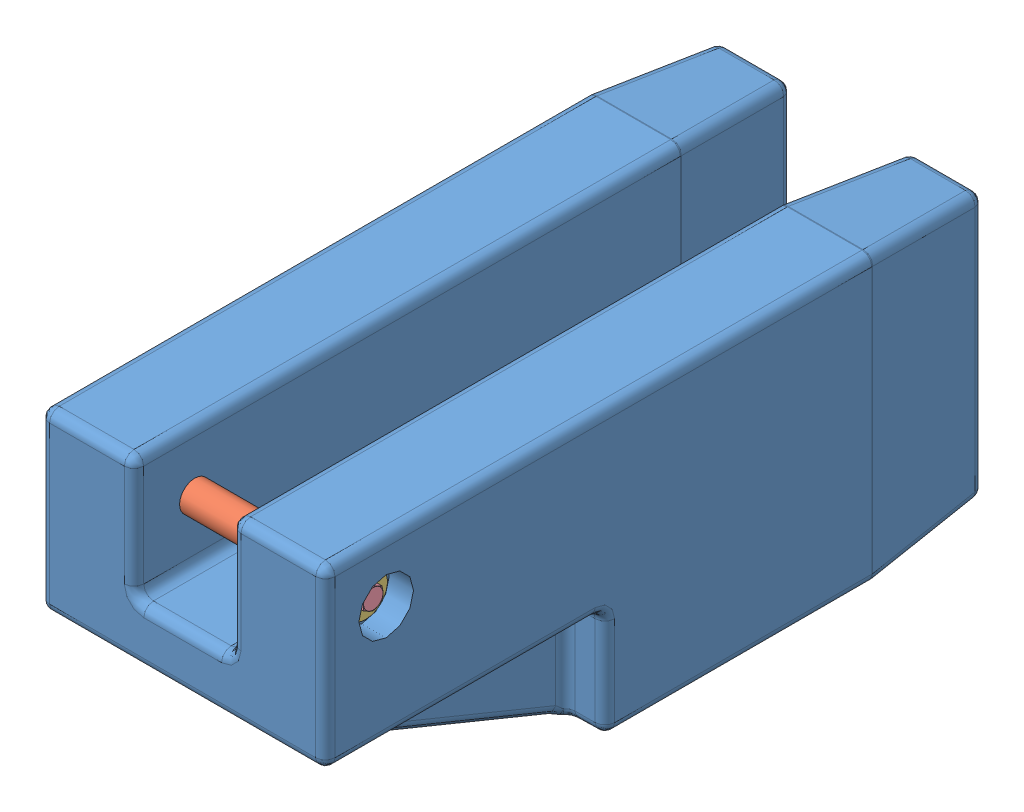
SolidWorks assembly Masse entiere.SLDASM, configuration Défaut (file format 3100). Lengths in mm.
Overall size (235 235 550).
6 component instances, 4 part files, 10 mates.
Components (placement in the parent):
- Masse-1: Masse.SLDPRT [Défaut] at (-101.5848 -149.9198 -175) size (235 235 550)
- Axe de masse-1: Axe de masse.SLDPRT [Défaut] at (-81.5848 35.0802 225) x (0 -0.010851 -0.999941) z (1 0 0) size (25 25 195)
- Rondelle large d10-1: Rondelle large d10.SLDPRT [Défaut] at (-84.5848 35.0802 225) size (3 36 36)
- Rondelle large d10-2: Rondelle large d10.SLDPRT [Défaut] at (113.4152 35.0802 225) x (1 0 0) z (0 0.004809 0.999988) size (3 36 36)
- Vis M10x16-1: Vis M10x16.SLDPRT [Défaut] at (-84.5848 35.0802 225) x (0 0.036153 -0.999346) z (1 0 0) size (16 18.48 22.4)
- Vis M10x16-2: Vis M10x16.SLDPRT [Défaut] at (116.4152 35.0802 225) x (0 -0.058815 0.998269) z (-1 0 0) size (16 18.48 22.4)
Mates (geometry in assembly coordinates):
- Coaxial1: concentric anti-aligned: cylinder of Rondelle large d10-1; cylinder of Vis M10x16-1
- Coïncidente1: coincident anti-aligned: plane of Rondelle large d10-1 through (-84.5848 35.0802 207) normal (-1 0 0); plane of Vis M10x16-1 through (-84.5848 39.9852 217.1722) normal (1 0 0)
- Coaxial2: concentric anti-aligned: cylinder of Axe de masse-1; cylinder of Vis M10x16-1
- Coïncidente2: coincident anti-aligned: plane of Axe de masse-1 through (-81.5848 35.0802 225) normal (-1 0 0); plane of Rondelle large d10-1 through (-81.5848 35.0802 207) normal (1 0 0)
- Coaxial3: concentric aligned: cylinder of Rondelle large d10-2; cylinder of Vis M10x16-2
- Coaxial4: concentric aligned: cylinder of Axe de masse-1; cylinder of Vis M10x16-2
- Coïncidente3: coincident anti-aligned: plane of Rondelle large d10-2 through (116.4152 34.9936 207.0002) normal (1 0 0); plane of Vis M10x16-2 through (116.4152 39.2205 233.2578) normal (-1 0 0)
- Coïncidente4: coincident anti-aligned: plane of Axe de masse-1 through (113.4152 35.0802 225) normal (1 0 0); plane of Rondelle large d10-2 through (113.4152 34.9936 207.0002) normal (-1 0 0)
- Coaxial5: concentric aligned: cylinder of Masse-1; cylinder of Axe de masse-1
- Coïncidente5: coincident anti-aligned: plane of Masse-1 through (-81.5848 35.0802 225) normal (-1 0 0); plane of Rondelle large d10-1 through (-81.5848 35.0802 207) normal (1 0 0)
